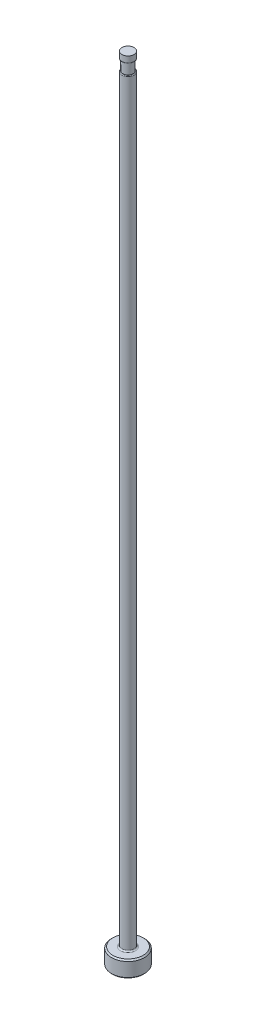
ISO-10303-21;
HEADER;
FILE_DESCRIPTION(('STEP AP214'),'2;1');
FILE_NAME('part.step','',(''),(''),'','','');
FILE_SCHEMA(('AUTOMOTIVE_DESIGN { 1 0 10303 214 1 1 1 1 }'));
ENDSEC;
DATA;
#1=APPLICATION_CONTEXT('core data for automotive mechanical design processes');
#2=APPLICATION_PROTOCOL_DEFINITION('international standard','automotive_design',2000,#1);
#3=PRODUCT_CONTEXT('',#1,'mechanical');
#4=PRODUCT('Part','Part','',(#3));
#5=PRODUCT_RELATED_PRODUCT_CATEGORY('part','',(#4));
#6=PRODUCT_DEFINITION_FORMATION('','',#4);
#7=PRODUCT_DEFINITION_CONTEXT('part definition',#1,'design');
#8=PRODUCT_DEFINITION('design','',#6,#7);
#9=PRODUCT_DEFINITION_SHAPE('','',#8);
#10=(LENGTH_UNIT() NAMED_UNIT(*) SI_UNIT(.MILLI.,.METRE.));
#11=(NAMED_UNIT(*) PLANE_ANGLE_UNIT() SI_UNIT($,.RADIAN.));
#12=(NAMED_UNIT(*) SI_UNIT($,.STERADIAN.) SOLID_ANGLE_UNIT());
#13=UNCERTAINTY_MEASURE_WITH_UNIT(LENGTH_MEASURE(1.E-05),#10,'distance_accuracy_value','');
#14=(GEOMETRIC_REPRESENTATION_CONTEXT(3) GLOBAL_UNCERTAINTY_ASSIGNED_CONTEXT((#13)) GLOBAL_UNIT_ASSIGNED_CONTEXT((#10,
#11,#12)) REPRESENTATION_CONTEXT('',''));
#15=CARTESIAN_POINT('',(0.,0.,0.));
#16=DIRECTION('',(0.,0.,1.));
#17=DIRECTION('',(1.,0.,0.));
#18=AXIS2_PLACEMENT_3D('',#15,#16,#17);
#19=CARTESIAN_POINT('',(-1.18998999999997,151.13,0.));
#20=DIRECTION('',(0.,1.,0.));
#21=DIRECTION('',(0.,0.,1.));
#22=AXIS2_PLACEMENT_3D('',#19,#20,#21);
#23=PLANE('',#22);
#24=CARTESIAN_POINT('',(0.,151.13,0.));
#25=DIRECTION('',(0.,1.,0.));
#26=DIRECTION('',(0.,0.,1.));
#27=AXIS2_PLACEMENT_3D('',#24,#25,#26);
#28=CIRCLE('',#27,1.05028999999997);
#29=CARTESIAN_POINT('',(0.,151.13,1.05028999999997));
#30=VERTEX_POINT('',#29);
#31=EDGE_CURVE('E11',#30,#30,#28,.F.);
#32=ORIENTED_EDGE('',*,*,#31,.T.);
#33=EDGE_LOOP('',(#32));
#34=FACE_BOUND('',#33,.T.);
#35=CARTESIAN_POINT('',(0.,151.13,0.));
#36=DIRECTION('',(0.,1.,0.));
#37=DIRECTION('',(0.,0.,1.));
#38=AXIS2_PLACEMENT_3D('',#35,#36,#37);
#39=CIRCLE('',#38,0.986789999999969);
#40=CARTESIAN_POINT('',(0.,151.13,0.986789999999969));
#41=VERTEX_POINT('',#40);
#42=EDGE_CURVE('E78',#41,#41,#39,.T.);
#43=ORIENTED_EDGE('',*,*,#42,.T.);
#44=EDGE_LOOP('',(#43));
#45=FACE_BOUND('',#44,.T.);
#46=ADVANCED_FACE('F36',(#34,#45),#23,.F.);
#47=CARTESIAN_POINT('',(0.,259.958771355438,0.));
#48=DIRECTION('',(0.,1.,0.));
#49=DIRECTION('',(0.,0.,1.));
#50=AXIS2_PLACEMENT_3D('',#47,#48,#49);
#51=CYLINDRICAL_SURFACE('',#50,1.18998999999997);
#52=DIRECTION('',(0.,1.,0.));
#53=VECTOR('',#52,1.);
#54=CARTESIAN_POINT('',(-0.986789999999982,259.958771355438,-0.66507269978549));
#55=LINE('',#54,#53);
#56=CARTESIAN_POINT('',(-0.986789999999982,148.971,-0.66507269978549));
#57=VERTEX_POINT('',#56);
#58=CARTESIAN_POINT('',(-0.986789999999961,86.614,-0.665072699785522));
#59=VERTEX_POINT('',#58);
#60=EDGE_CURVE('E73',#57,#59,#55,.F.);
#61=ORIENTED_EDGE('',*,*,#60,.F.);
#62=CARTESIAN_POINT('',(0.,148.971,0.));
#63=DIRECTION('',(0.,-1.,0.));
#64=DIRECTION('',(0.,0.,-1.));
#65=AXIS2_PLACEMENT_3D('',#62,#63,#64);
#66=CIRCLE('',#65,1.18998999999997);
#67=CARTESIAN_POINT('',(-0.986789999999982,148.971,0.66507269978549));
#68=VERTEX_POINT('',#67);
#69=EDGE_CURVE('E51',#57,#68,#66,.T.);
#70=ORIENTED_EDGE('',*,*,#69,.T.);
#71=DIRECTION('',(0.,1.,0.));
#72=VECTOR('',#71,1.);
#73=CARTESIAN_POINT('',(-0.986789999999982,259.958771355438,0.66507269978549));
#74=LINE('',#73,#72);
#75=CARTESIAN_POINT('',(-0.986789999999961,86.614,0.665072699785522));
#76=VERTEX_POINT('',#75);
#77=EDGE_CURVE('E84',#76,#68,#74,.T.);
#78=ORIENTED_EDGE('',*,*,#77,.F.);
#79=CARTESIAN_POINT('',(-0.98678999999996,86.614,-0.665072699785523));
#80=CARTESIAN_POINT('',(-0.986779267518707,86.563745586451,-0.66504129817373));
#81=CARTESIAN_POINT('',(-0.987982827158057,86.5134764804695,-0.663300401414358));
#82=CARTESIAN_POINT('',(-0.992752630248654,86.4131549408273,-0.656166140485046));
#83=CARTESIAN_POINT('',(-0.996326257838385,86.3631036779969,-0.650761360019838));
#84=CARTESIAN_POINT('',(-1.00583006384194,86.2631462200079,-0.635968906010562));
#85=CARTESIAN_POINT('',(-1.01178989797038,86.2132501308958,-0.626531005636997));
#86=CARTESIAN_POINT('',(-1.02587369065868,86.1148860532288,-0.603197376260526));
#87=CARTESIAN_POINT('',(-1.03399424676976,86.0664159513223,-0.589308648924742));
#88=CARTESIAN_POINT('',(-1.05174573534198,85.9733689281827,-0.556987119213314));
#89=CARTESIAN_POINT('',(-1.06130874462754,85.9287141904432,-0.538743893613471));
#90=CARTESIAN_POINT('',(-1.08163376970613,85.8425015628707,-0.496679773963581));
#91=CARTESIAN_POINT('',(-1.09239187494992,85.8009342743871,-0.472876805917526));
#92=CARTESIAN_POINT('',(-1.11191043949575,85.7308889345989,-0.424562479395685));
#93=CARTESIAN_POINT('',(-1.12059949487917,85.7015247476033,-0.401318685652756));
#94=CARTESIAN_POINT('',(-1.13756139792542,85.6467968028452,-0.350355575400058));
#95=CARTESIAN_POINT('',(-1.1458348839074,85.6214267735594,-0.322643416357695));
#96=CARTESIAN_POINT('',(-1.15898696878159,85.5824463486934,-0.270798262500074));
#97=CARTESIAN_POINT('',(-1.16417674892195,85.5675145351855,-0.24774326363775));
#98=CARTESIAN_POINT('',(-1.17342649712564,85.5413860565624,-0.199376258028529));
#99=CARTESIAN_POINT('',(-1.17748715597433,85.5301871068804,-0.174065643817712));
#100=CARTESIAN_POINT('',(-1.18407630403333,85.5122102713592,-0.121438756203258));
#101=CARTESIAN_POINT('',(-1.18659047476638,85.5054736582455,-0.0941062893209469));
#102=CARTESIAN_POINT('',(-1.18968900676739,85.4971911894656,-0.0385610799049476));
#103=CARTESIAN_POINT('',(-1.19027509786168,85.4956406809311,-0.0103491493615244));
#104=CARTESIAN_POINT('',(-1.18949770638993,85.4977102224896,0.0419738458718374));
#105=CARTESIAN_POINT('',(-1.18838954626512,85.5006530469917,0.0661187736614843));
#106=CARTESIAN_POINT('',(-1.18479997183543,85.5102873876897,0.113537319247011));
#107=CARTESIAN_POINT('',(-1.1823183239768,85.5169795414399,0.136810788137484));
#108=CARTESIAN_POINT('',(-1.17619659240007,85.533751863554,0.18211276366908));
#109=CARTESIAN_POINT('',(-1.17254841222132,85.5438557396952,0.204131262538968));
#110=CARTESIAN_POINT('',(-1.16439345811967,85.5669140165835,0.24643226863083));
#111=CARTESIAN_POINT('',(-1.15988634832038,85.5798695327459,0.266714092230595));
#112=CARTESIAN_POINT('',(-1.14755888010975,85.6162124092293,0.316494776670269));
#113=CARTESIAN_POINT('',(-1.13931800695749,85.6413279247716,0.344629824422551));
#114=CARTESIAN_POINT('',(-1.12235845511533,85.6956867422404,0.396399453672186));
#115=CARTESIAN_POINT('',(-1.11363866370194,85.7249399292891,0.420022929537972));
#116=CARTESIAN_POINT('',(-1.09186647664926,85.8024930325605,0.47452003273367));
#117=CARTESIAN_POINT('',(-1.07894485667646,85.8527247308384,0.502681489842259));
#118=CARTESIAN_POINT('',(-1.05496207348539,85.957372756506,0.55123785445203));
#119=CARTESIAN_POINT('',(-1.04391025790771,86.0118082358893,0.571594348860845));
#120=CARTESIAN_POINT('',(-1.02648158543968,86.1115321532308,0.602203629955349));
#121=CARTESIAN_POINT('',(-1.01961050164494,86.156371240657,0.613676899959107));
#122=CARTESIAN_POINT('',(-1.00772789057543,86.2471036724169,0.633000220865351));
#123=CARTESIAN_POINT('',(-1.00271814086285,86.2929979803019,0.640846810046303));
#124=CARTESIAN_POINT('',(-0.99475556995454,86.384656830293,0.653140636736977));
#125=CARTESIAN_POINT('',(-0.991771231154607,86.4304117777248,0.657640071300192));
#126=CARTESIAN_POINT('',(-0.987786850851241,86.5221143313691,0.663592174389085));
#127=CARTESIAN_POINT('',(-0.986782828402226,86.5680613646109,0.665050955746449));
#128=CARTESIAN_POINT('',(-0.98678999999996,86.614,0.665072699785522));
#129=B_SPLINE_CURVE_WITH_KNOTS('',3,(#79,#80,#81,#82,#83,#84,#85,#86,#87,#88,#89,#90,#91,#92,
#93,#94,#95,#96,#97,#98,#99,#100,#101,#102,#103,#104,#105,#106,#107,#108,#109,#110,#111,#112,
#113,#114,#115,#116,#117,#118,#119,#120,#121,#122,#123,#124,#125,#126,#127,#128),.UNSPECIFIED.,
.F.,.F.,(4,2,2,2,2,2,2,2,2,2,2,2,2,2,2,2,2,2,2,2,2,2,2,2,4),(0.,0.150742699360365,
0.301957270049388,0.455112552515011,0.608028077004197,0.75521904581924,0.901941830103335,
1.01691912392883,1.13171404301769,1.21527204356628,1.29877881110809,1.3830475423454,
1.46724064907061,1.53993547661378,1.61264266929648,1.68586586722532,1.75911775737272,
1.87427009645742,1.98970233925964,2.16578434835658,2.34272217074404,2.48289840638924,
2.62320816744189,2.7612811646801,2.8990763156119),.UNSPECIFIED.);
#130=EDGE_CURVE('E81',#59,#76,#129,.T.);
#131=ORIENTED_EDGE('',*,*,#130,.F.);
#132=EDGE_LOOP('',(#61,#70,#78,#131));
#133=FACE_BOUND('',#132,.T.);
#134=CARTESIAN_POINT('',(0.,3.42900000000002,0.));
#135=DIRECTION('',(0.,1.,0.));
#136=DIRECTION('',(0.,0.,1.));
#137=AXIS2_PLACEMENT_3D('',#134,#135,#136);
#138=CIRCLE('',#137,1.18998999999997);
#139=CARTESIAN_POINT('',(0.,3.42900000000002,1.18998999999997));
#140=VERTEX_POINT('',#139);
#141=EDGE_CURVE('E116',#140,#140,#138,.T.);
#142=ORIENTED_EDGE('',*,*,#141,.T.);
#143=EDGE_LOOP('',(#142));
#144=FACE_BOUND('',#143,.T.);
#145=ADVANCED_FACE('F82',(#133,#144),#51,.T.);
#146=CARTESIAN_POINT('',(0.,0.,0.));
#147=DIRECTION('',(0.,-1.,0.));
#148=DIRECTION('',(0.,0.,-1.));
#149=AXIS2_PLACEMENT_3D('',#146,#147,#148);
#150=PLANE('',#149);
#151=CARTESIAN_POINT('',(0.,0.,0.));
#152=DIRECTION('',(0.,-1.,0.));
#153=DIRECTION('',(0.,0.,-1.));
#154=AXIS2_PLACEMENT_3D('',#151,#152,#153);
#155=CIRCLE('',#154,2.92099999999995);
#156=CARTESIAN_POINT('',(0.,0.,-2.92099999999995));
#157=VERTEX_POINT('',#156);
#158=EDGE_CURVE('E113',#157,#157,#155,.T.);
#159=ORIENTED_EDGE('',*,*,#158,.T.);
#160=EDGE_LOOP('',(#159));
#161=FACE_BOUND('',#160,.T.);
#162=ADVANCED_FACE('F192',(#161),#150,.T.);
#163=CARTESIAN_POINT('',(0.,259.958771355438,0.));
#164=DIRECTION('',(0.,1.,0.));
#165=DIRECTION('',(0.,0.,1.));
#166=AXIS2_PLACEMENT_3D('',#163,#164,#165);
#167=CYLINDRICAL_SURFACE('',#166,3.17499999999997);
#168=CARTESIAN_POINT('',(0.,2.92100000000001,0.));
#169=DIRECTION('',(0.,1.,0.));
#170=DIRECTION('',(0.,0.,1.));
#171=AXIS2_PLACEMENT_3D('',#168,#169,#170);
#172=CIRCLE('',#171,3.17499999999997);
#173=CARTESIAN_POINT('',(0.,2.92100000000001,3.17499999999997));
#174=VERTEX_POINT('',#173);
#175=EDGE_CURVE('E110',#174,#174,#172,.F.);
#176=ORIENTED_EDGE('',*,*,#175,.T.);
#177=EDGE_LOOP('',(#176));
#178=FACE_BOUND('',#177,.T.);
#179=CARTESIAN_POINT('',(0.,0.254000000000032,0.));
#180=DIRECTION('',(0.,-1.,0.));
#181=DIRECTION('',(0.,0.,-1.));
#182=AXIS2_PLACEMENT_3D('',#179,#180,#181);
#183=CIRCLE('',#182,3.17499999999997);
#184=CARTESIAN_POINT('',(0.,0.254000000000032,-3.17499999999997));
#185=VERTEX_POINT('',#184);
#186=EDGE_CURVE('E107',#185,#185,#183,.F.);
#187=ORIENTED_EDGE('',*,*,#186,.T.);
#188=EDGE_LOOP('',(#187));
#189=FACE_BOUND('',#188,.T.);
#190=ADVANCED_FACE('F195',(#178,#189),#167,.T.);
#191=CARTESIAN_POINT('',(-3.17499999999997,3.175,0.));
#192=DIRECTION('',(0.,1.,0.));
#193=DIRECTION('',(0.,0.,1.));
#194=AXIS2_PLACEMENT_3D('',#191,#192,#193);
#195=PLANE('',#194);
#196=CARTESIAN_POINT('',(0.,3.175,0.));
#197=DIRECTION('',(0.,1.,0.));
#198=DIRECTION('',(0.,0.,1.));
#199=AXIS2_PLACEMENT_3D('',#196,#197,#198);
#200=CIRCLE('',#199,1.44398999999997);
#201=CARTESIAN_POINT('',(0.,3.175,1.44398999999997));
#202=VERTEX_POINT('',#201);
#203=EDGE_CURVE('E87',#202,#202,#200,.F.);
#204=ORIENTED_EDGE('',*,*,#203,.T.);
#205=EDGE_LOOP('',(#204));
#206=FACE_BOUND('',#205,.T.);
#207=CARTESIAN_POINT('',(0.,3.175,0.));
#208=DIRECTION('',(0.,1.,0.));
#209=DIRECTION('',(0.,0.,1.));
#210=AXIS2_PLACEMENT_3D('',#207,#208,#209);
#211=CIRCLE('',#210,2.92099999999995);
#212=CARTESIAN_POINT('',(0.,3.175,2.92099999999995));
#213=VERTEX_POINT('',#212);
#214=EDGE_CURVE('E104',#213,#213,#211,.T.);
#215=ORIENTED_EDGE('',*,*,#214,.T.);
#216=EDGE_LOOP('',(#215));
#217=FACE_BOUND('',#216,.T.);
#218=ADVANCED_FACE('F190',(#206,#217),#195,.T.);
#219=CARTESIAN_POINT('',(0.,3.17499999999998,0.));
#220=DIRECTION('',(0.,-1.,0.));
#221=DIRECTION('',(0.,0.,-1.));
#222=AXIS2_PLACEMENT_3D('',#219,#220,#221);
#223=CONICAL_SURFACE('',#222,2.92099999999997,0.7853981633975);
#224=ORIENTED_EDGE('',*,*,#175,.F.);
#225=EDGE_LOOP('',(#224));
#226=FACE_BOUND('',#225,.T.);
#227=ORIENTED_EDGE('',*,*,#214,.F.);
#228=EDGE_LOOP('',(#227));
#229=FACE_BOUND('',#228,.T.);
#230=ADVANCED_FACE('F186',(#226,#229),#223,.T.);
#231=CARTESIAN_POINT('',(0.,0.254000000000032,0.));
#232=DIRECTION('',(0.,1.,0.));
#233=DIRECTION('',(0.,0.,1.));
#234=AXIS2_PLACEMENT_3D('',#231,#232,#233);
#235=CONICAL_SURFACE('',#234,3.17499999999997,0.785398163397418);
#236=ORIENTED_EDGE('',*,*,#158,.F.);
#237=EDGE_LOOP('',(#236));
#238=FACE_BOUND('',#237,.T.);
#239=ORIENTED_EDGE('',*,*,#186,.F.);
#240=EDGE_LOOP('',(#239));
#241=FACE_BOUND('',#240,.T.);
#242=ADVANCED_FACE('F182',(#238,#241),#235,.T.);
#243=CARTESIAN_POINT('',(0.,3.42900000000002,0.));
#244=DIRECTION('',(0.,1.,0.));
#245=DIRECTION('',(0.,0.,1.));
#246=AXIS2_PLACEMENT_3D('',#243,#244,#245);
#247=TOROIDAL_SURFACE('',#246,1.44398999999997,0.254);
#248=ORIENTED_EDGE('',*,*,#203,.F.);
#249=EDGE_LOOP('',(#248));
#250=FACE_BOUND('',#249,.T.);
#251=ORIENTED_EDGE('',*,*,#141,.F.);
#252=EDGE_LOOP('',(#251));
#253=FACE_BOUND('',#252,.T.);
#254=ADVANCED_FACE('F147',(#250,#253),#247,.F.);
#255=CARTESIAN_POINT('',(-1.18998999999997,149.098,0.));
#256=DIRECTION('',(0.,-1.,0.));
#257=DIRECTION('',(0.,0.,-1.));
#258=AXIS2_PLACEMENT_3D('',#255,#256,#257);
#259=PLANE('',#258);
#260=DIRECTION('',(0.,0.,1.));
#261=VECTOR('',#260,1.);
#262=CARTESIAN_POINT('',(-0.986789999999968,149.098,0.));
#263=LINE('',#262,#261);
#264=CARTESIAN_POINT('',(-0.986789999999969,149.098,0.));
#265=VERTEX_POINT('',#264);
#266=CARTESIAN_POINT('',(-0.986789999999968,149.098,0.39521289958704));
#267=VERTEX_POINT('',#266);
#268=EDGE_CURVE('E90',#265,#267,#263,.T.);
#269=ORIENTED_EDGE('',*,*,#268,.T.);
#270=CARTESIAN_POINT('',(0.,149.098,0.));
#271=DIRECTION('',(0.,-1.,0.));
#272=DIRECTION('',(0.,0.,-1.));
#273=AXIS2_PLACEMENT_3D('',#270,#271,#272);
#274=CIRCLE('',#273,1.06298999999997);
#275=CARTESIAN_POINT('',(-0.986789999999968,149.098,-0.39521289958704));
#276=VERTEX_POINT('',#275);
#277=EDGE_CURVE('E86',#267,#276,#274,.F.);
#278=ORIENTED_EDGE('',*,*,#277,.T.);
#279=EDGE_CURVE('E79',#276,#265,#263,.T.);
#280=ORIENTED_EDGE('',*,*,#279,.T.);
#281=CARTESIAN_POINT('',(0.,149.098,0.));
#282=DIRECTION('',(0.,1.,0.));
#283=DIRECTION('',(0.,0.,1.));
#284=AXIS2_PLACEMENT_3D('',#281,#282,#283);
#285=CIRCLE('',#284,0.986789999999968);
#286=EDGE_CURVE('E101',#265,#265,#285,.T.);
#287=ORIENTED_EDGE('',*,*,#286,.F.);
#288=EDGE_LOOP('',(#269,#278,#280,#287));
#289=FACE_BOUND('',#288,.T.);
#290=ADVANCED_FACE('F144',(#289),#259,.F.);
#291=CARTESIAN_POINT('',(0.,153.448281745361,0.));
#292=DIRECTION('',(0.,1.,0.));
#293=DIRECTION('',(0.,0.,1.));
#294=AXIS2_PLACEMENT_3D('',#291,#292,#293);
#295=CYLINDRICAL_SURFACE('',#294,0.986789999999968);
#296=ORIENTED_EDGE('',*,*,#42,.F.);
#297=EDGE_LOOP('',(#296));
#298=FACE_BOUND('',#297,.T.);
#299=ORIENTED_EDGE('',*,*,#286,.T.);
#300=EDGE_LOOP('',(#299));
#301=FACE_BOUND('',#300,.T.);
#302=ADVANCED_FACE('F141',(#298,#301),#295,.T.);
#303=CARTESIAN_POINT('',(-0.986789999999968,150.114,-3.17499999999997));
#304=DIRECTION('',(1.,0.,0.));
#305=DIRECTION('',(0.,1.,0.));
#306=AXIS2_PLACEMENT_3D('',#303,#304,#305);
#307=PLANE('',#306);
#308=ORIENTED_EDGE('',*,*,#279,.F.);
#309=CARTESIAN_POINT('',(-0.986789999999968,149.098,-0.39521289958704));
#310=CARTESIAN_POINT('',(-0.986789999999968,149.097995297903,-0.407444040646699));
#311=CARTESIAN_POINT('',(-0.986789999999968,149.097755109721,-0.419683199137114));
#312=CARTESIAN_POINT('',(-0.986789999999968,149.096653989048,-0.444183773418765));
#313=CARTESIAN_POINT('',(-0.986789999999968,149.095790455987,-0.456445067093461));
#314=CARTESIAN_POINT('',(-0.986789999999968,149.093278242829,-0.481011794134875));
#315=CARTESIAN_POINT('',(-0.986789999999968,149.091621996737,-0.493316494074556));
#316=CARTESIAN_POINT('',(-0.986789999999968,149.087322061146,-0.517737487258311));
#317=CARTESIAN_POINT('',(-0.986789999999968,149.084680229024,-0.529854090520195));
#318=CARTESIAN_POINT('',(-0.986789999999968,149.079166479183,-0.550007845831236));
#319=CARTESIAN_POINT('',(-0.986789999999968,149.076625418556,-0.558134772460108));
#320=CARTESIAN_POINT('',(-0.986789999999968,149.070838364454,-0.574135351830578));
#321=CARTESIAN_POINT('',(-0.986789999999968,149.06759268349,-0.582009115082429));
#322=CARTESIAN_POINT('',(-0.986789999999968,149.060227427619,-0.597422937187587));
#323=CARTESIAN_POINT('',(-0.986789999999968,149.05610093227,-0.604959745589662));
#324=CARTESIAN_POINT('',(-0.986789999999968,149.04681754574,-0.619377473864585));
#325=CARTESIAN_POINT('',(-0.986789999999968,149.041662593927,-0.626259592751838));
#326=CARTESIAN_POINT('',(-0.986789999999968,149.032322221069,-0.636549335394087));
#327=CARTESIAN_POINT('',(-0.986789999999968,149.028503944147,-0.640288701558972));
#328=CARTESIAN_POINT('',(-0.986789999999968,149.020372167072,-0.647191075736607));
#329=CARTESIAN_POINT('',(-0.986789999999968,149.01605907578,-0.650354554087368));
#330=CARTESIAN_POINT('',(-0.986789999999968,149.007638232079,-0.655489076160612));
#331=CARTESIAN_POINT('',(-0.986789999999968,149.003596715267,-0.657567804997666));
#332=CARTESIAN_POINT('',(-0.986789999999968,148.995227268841,-0.661024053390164));
#333=CARTESIAN_POINT('',(-0.986789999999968,148.99090005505,-0.662403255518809));
#334=CARTESIAN_POINT('',(-0.986789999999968,148.98394708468,-0.663934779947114));
#335=CARTESIAN_POINT('',(-0.986789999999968,148.981379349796,-0.664359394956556));
#336=CARTESIAN_POINT('',(-0.986789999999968,148.976208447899,-0.664929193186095));
#337=CARTESIAN_POINT('',(-0.986789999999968,148.973605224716,-0.665073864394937));
#338=CARTESIAN_POINT('',(-0.986789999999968,148.971000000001,-0.665072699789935));
#339=B_SPLINE_CURVE_WITH_KNOTS('',3,(#309,#310,#311,#312,#313,#314,#315,#316,#317,#318,#319,
#320,#321,#322,#323,#324,#325,#326,#327,#328,#329,#330,#331,#332,#333,#334,#335,#336,#337,#338),
.UNSPECIFIED.,.F.,.F.,(4,2,2,2,2,2,2,2,2,2,2,2,2,2,4),(0.,0.0367035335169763,0.0735610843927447,
0.110777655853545,0.147924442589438,0.173443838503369,0.198951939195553,0.224668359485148,
0.250336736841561,0.266328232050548,0.282306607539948,0.295888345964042,0.309437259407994,
0.317231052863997,0.325039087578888),.UNSPECIFIED.);
#340=EDGE_CURVE('E59',#276,#57,#339,.T.);
#341=ORIENTED_EDGE('',*,*,#340,.T.);
#342=ORIENTED_EDGE('',*,*,#60,.T.);
#343=DIRECTION('',(0.,0.,1.));
#344=VECTOR('',#343,1.);
#345=CARTESIAN_POINT('',(-0.986789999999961,86.614,-3.17499999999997));
#346=LINE('',#345,#344);
#347=EDGE_CURVE('E77',#59,#76,#346,.T.);
#348=ORIENTED_EDGE('',*,*,#347,.T.);
#349=ORIENTED_EDGE('',*,*,#77,.T.);
#350=CARTESIAN_POINT('',(-0.986789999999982,148.971,0.66507269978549));
#351=CARTESIAN_POINT('',(-0.986789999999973,148.975976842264,0.665089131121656));
#352=CARTESIAN_POINT('',(-0.986789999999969,148.980932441,0.664550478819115));
#353=CARTESIAN_POINT('',(-0.986789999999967,148.990580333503,0.662514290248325));
#354=CARTESIAN_POINT('',(-0.986789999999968,148.995275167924,0.661028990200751));
#355=CARTESIAN_POINT('',(-0.986789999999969,149.004292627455,0.657253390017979));
#356=CARTESIAN_POINT('',(-0.986789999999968,149.00861696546,0.654967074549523));
#357=CARTESIAN_POINT('',(-0.986789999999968,149.016874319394,0.649756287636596));
#358=CARTESIAN_POINT('',(-0.986789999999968,149.02080595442,0.646829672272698));
#359=CARTESIAN_POINT('',(-0.986789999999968,149.030276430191,0.638773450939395));
#360=CARTESIAN_POINT('',(-0.986789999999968,149.035529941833,0.633310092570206));
#361=CARTESIAN_POINT('',(-0.986789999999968,149.045132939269,0.62165056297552));
#362=CARTESIAN_POINT('',(-0.986789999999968,149.049480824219,0.615453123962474));
#363=CARTESIAN_POINT('',(-0.986789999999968,149.060260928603,0.59794170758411));
#364=CARTESIAN_POINT('',(-0.986789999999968,149.065932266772,0.586163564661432));
#365=CARTESIAN_POINT('',(-0.986789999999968,149.075557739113,0.561881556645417));
#366=CARTESIAN_POINT('',(-0.986789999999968,149.079500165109,0.54937337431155));
#367=CARTESIAN_POINT('',(-0.986789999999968,149.085776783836,0.525021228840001));
#368=CARTESIAN_POINT('',(-0.986789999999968,149.088213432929,0.513202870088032));
#369=CARTESIAN_POINT('',(-0.986789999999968,149.092177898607,0.489402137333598));
#370=CARTESIAN_POINT('',(-0.986789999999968,149.093704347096,0.477419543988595));
#371=CARTESIAN_POINT('',(-0.986789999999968,149.095993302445,0.453722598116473));
#372=CARTESIAN_POINT('',(-0.986789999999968,149.096775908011,0.442010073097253));
#373=CARTESIAN_POINT('',(-0.986789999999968,149.097776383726,0.418600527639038));
#374=CARTESIAN_POINT('',(-0.986789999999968,149.097996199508,0.406903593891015));
#375=CARTESIAN_POINT('',(-0.986789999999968,149.098,0.395212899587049));
#376=B_SPLINE_CURVE_WITH_KNOTS('',3,(#350,#351,#352,#353,#354,#355,#356,#357,#358,#359,#360,
#361,#362,#363,#364,#365,#366,#367,#368,#369,#370,#371,#372,#373,#374,#375),.UNSPECIFIED.,.F.,
.F.,(4,2,2,2,2,2,2,2,2,2,2,2,4),(0.,0.0148678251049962,0.0295472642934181,0.0441546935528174,
0.0588118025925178,0.0814211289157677,0.104070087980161,0.143067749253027,0.182325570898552,
0.218481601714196,0.254691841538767,0.289893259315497,0.324972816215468),.UNSPECIFIED.);
#377=EDGE_CURVE('E172',#68,#267,#376,.T.);
#378=ORIENTED_EDGE('',*,*,#377,.T.);
#379=ORIENTED_EDGE('',*,*,#268,.F.);
#380=EDGE_LOOP('',(#308,#341,#342,#348,#349,#378,#379));
#381=FACE_BOUND('',#380,.T.);
#382=ADVANCED_FACE('F75',(#381),#307,.F.);
#383=CARTESIAN_POINT('',(-4.16178999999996,86.614,-3.17499999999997));
#384=DIRECTION('',(0.,0.,1.));
#385=DIRECTION('',(1.,0.,0.));
#386=AXIS2_PLACEMENT_3D('',#383,#384,#385);
#387=CYLINDRICAL_SURFACE('',#386,3.175);
#388=ORIENTED_EDGE('',*,*,#347,.F.);
#389=ORIENTED_EDGE('',*,*,#130,.T.);
#390=EDGE_LOOP('',(#388,#389));
#391=FACE_BOUND('',#390,.T.);
#392=ADVANCED_FACE('F89',(#391),#387,.F.);
#393=CARTESIAN_POINT('',(0.,152.687735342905,0.));
#394=DIRECTION('',(0.,1.,0.));
#395=DIRECTION('',(0.,0.,1.));
#396=AXIS2_PLACEMENT_3D('',#393,#394,#395);
#397=CYLINDRICAL_SURFACE('',#396,1.17728999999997);
#398=CARTESIAN_POINT('',(0.,151.257,0.));
#399=DIRECTION('',(0.,1.,0.));
#400=DIRECTION('',(0.,0.,1.));
#401=AXIS2_PLACEMENT_3D('',#398,#399,#400);
#402=CIRCLE('',#401,1.17728999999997);
#403=CARTESIAN_POINT('',(0.,151.257,1.17728999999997));
#404=VERTEX_POINT('',#403);
#405=EDGE_CURVE('E44',#404,#404,#402,.T.);
#406=ORIENTED_EDGE('',*,*,#405,.T.);
#407=EDGE_LOOP('',(#406));
#408=FACE_BOUND('',#407,.T.);
#409=CARTESIAN_POINT('',(0.,152.4,0.));
#410=DIRECTION('',(0.,1.,0.));
#411=DIRECTION('',(0.,0.,1.));
#412=AXIS2_PLACEMENT_3D('',#409,#410,#411);
#413=CIRCLE('',#412,1.17728999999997);
#414=CARTESIAN_POINT('',(0.,152.4,1.17728999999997));
#415=VERTEX_POINT('',#414);
#416=EDGE_CURVE('E91',#415,#415,#413,.T.);
#417=ORIENTED_EDGE('',*,*,#416,.F.);
#418=EDGE_LOOP('',(#417));
#419=FACE_BOUND('',#418,.T.);
#420=ADVANCED_FACE('F135',(#408,#419),#397,.T.);
#421=CARTESIAN_POINT('',(-1.18998999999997,152.4,0.));
#422=DIRECTION('',(0.,1.,0.));
#423=DIRECTION('',(0.,0.,1.));
#424=AXIS2_PLACEMENT_3D('',#421,#422,#423);
#425=PLANE('',#424);
#426=ORIENTED_EDGE('',*,*,#416,.T.);
#427=EDGE_LOOP('',(#426));
#428=FACE_BOUND('',#427,.T.);
#429=ADVANCED_FACE('F149',(#428),#425,.T.);
#430=CARTESIAN_POINT('',(0.,148.971,0.));
#431=DIRECTION('',(0.,-1.,0.));
#432=DIRECTION('',(0.,0.,-1.));
#433=AXIS2_PLACEMENT_3D('',#430,#431,#432);
#434=TOROIDAL_SURFACE('',#433,1.06298999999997,0.127);
#435=ORIENTED_EDGE('',*,*,#377,.F.);
#436=ORIENTED_EDGE('',*,*,#69,.F.);
#437=ORIENTED_EDGE('',*,*,#340,.F.);
#438=ORIENTED_EDGE('',*,*,#277,.F.);
#439=EDGE_LOOP('',(#435,#436,#437,#438));
#440=FACE_BOUND('',#439,.T.);
#441=ADVANCED_FACE('F151',(#440),#434,.T.);
#442=CARTESIAN_POINT('',(0.,151.257,0.));
#443=DIRECTION('',(0.,1.,0.));
#444=DIRECTION('',(0.,0.,1.));
#445=AXIS2_PLACEMENT_3D('',#442,#443,#444);
#446=TOROIDAL_SURFACE('',#445,1.05028999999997,0.127);
#447=ORIENTED_EDGE('',*,*,#31,.F.);
#448=EDGE_LOOP('',(#447));
#449=FACE_BOUND('',#448,.T.);
#450=ORIENTED_EDGE('',*,*,#405,.F.);
#451=EDGE_LOOP('',(#450));
#452=FACE_BOUND('',#451,.T.);
#453=ADVANCED_FACE('F38',(#449,#452),#446,.T.);
#454=CLOSED_SHELL('',(#46,#145,#162,#190,#218,#230,#242,#254,#290,#302,#382,#392,#420,#429,#441,#453));
#455=MANIFOLD_SOLID_BREP('B2',#454);
#456=ADVANCED_BREP_SHAPE_REPRESENTATION('',(#18,#455),#14);
#457=SHAPE_DEFINITION_REPRESENTATION(#9,#456);
ENDSEC;
END-ISO-10303-21;
